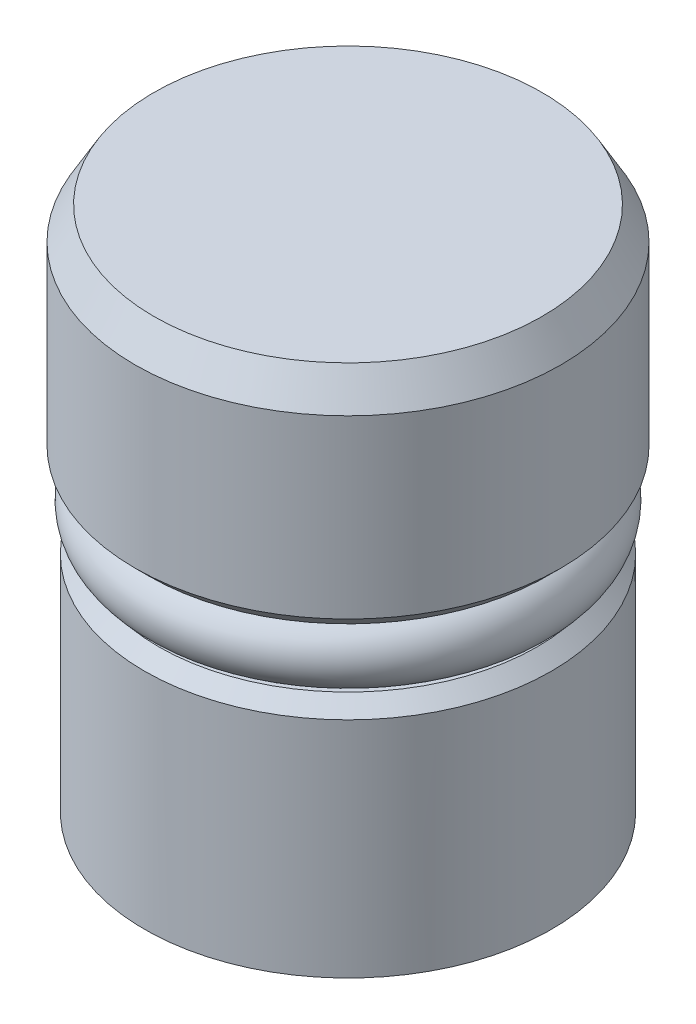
ISO-10303-21;
HEADER;
FILE_DESCRIPTION(('STEP AP214'),'2;1');
FILE_NAME('part.step','',(''),(''),'','','');
FILE_SCHEMA(('AUTOMOTIVE_DESIGN { 1 0 10303 214 1 1 1 1 }'));
ENDSEC;
DATA;
#1=APPLICATION_CONTEXT('core data for automotive mechanical design processes');
#2=APPLICATION_PROTOCOL_DEFINITION('international standard','automotive_design',2000,#1);
#3=PRODUCT_CONTEXT('',#1,'mechanical');
#4=PRODUCT('Part','Part','',(#3));
#5=PRODUCT_RELATED_PRODUCT_CATEGORY('part','',(#4));
#6=PRODUCT_DEFINITION_FORMATION('','',#4);
#7=PRODUCT_DEFINITION_CONTEXT('part definition',#1,'design');
#8=PRODUCT_DEFINITION('design','',#6,#7);
#9=PRODUCT_DEFINITION_SHAPE('','',#8);
#10=(LENGTH_UNIT() NAMED_UNIT(*) SI_UNIT(.MILLI.,.METRE.));
#11=(NAMED_UNIT(*) PLANE_ANGLE_UNIT() SI_UNIT($,.RADIAN.));
#12=(NAMED_UNIT(*) SI_UNIT($,.STERADIAN.) SOLID_ANGLE_UNIT());
#13=UNCERTAINTY_MEASURE_WITH_UNIT(LENGTH_MEASURE(1.E-05),#10,'distance_accuracy_value','');
#14=(GEOMETRIC_REPRESENTATION_CONTEXT(3) GLOBAL_UNCERTAINTY_ASSIGNED_CONTEXT((#13)) GLOBAL_UNIT_ASSIGNED_CONTEXT((#10,
#11,#12)) REPRESENTATION_CONTEXT('',''));
#15=CARTESIAN_POINT('',(0.,0.,0.));
#16=DIRECTION('',(0.,0.,1.));
#17=DIRECTION('',(1.,0.,0.));
#18=AXIS2_PLACEMENT_3D('',#15,#16,#17);
#19=CARTESIAN_POINT('',(0.,3.302,0.));
#20=DIRECTION('',(0.,1.,0.));
#21=DIRECTION('',(0.,0.,1.));
#22=AXIS2_PLACEMENT_3D('',#19,#20,#21);
#23=PLANE('',#22);
#24=CARTESIAN_POINT('',(0.,3.302,0.));
#25=DIRECTION('',(0.,-1.,0.));
#26=DIRECTION('',(0.,0.,-1.));
#27=AXIS2_PLACEMENT_3D('',#24,#25,#26);
#28=CIRCLE('',#27,2.5527);
#29=CARTESIAN_POINT('',(0.,3.302,-2.5527));
#30=VERTEX_POINT('',#29);
#31=EDGE_CURVE('P0_E46',#30,#30,#28,.T.);
#32=ORIENTED_EDGE('',*,*,#31,.T.);
#33=EDGE_LOOP('',(#32));
#34=FACE_BOUND('',#33,.T.);
#35=CARTESIAN_POINT('',(0.,3.302,0.));
#36=DIRECTION('',(0.,-1.,0.));
#37=DIRECTION('',(0.,0.,-1.));
#38=AXIS2_PLACEMENT_3D('',#35,#36,#37);
#39=CIRCLE('',#38,2.0193);
#40=CARTESIAN_POINT('',(0.,3.302,-2.0193));
#41=VERTEX_POINT('',#40);
#42=EDGE_CURVE('P0_E36',#41,#41,#39,.T.);
#43=ORIENTED_EDGE('',*,*,#42,.F.);
#44=EDGE_LOOP('',(#43));
#45=FACE_BOUND('',#44,.T.);
#46=ADVANCED_FACE('P0_F15',(#34,#45),#23,.F.);
#47=CARTESIAN_POINT('',(0.,0.,0.));
#48=DIRECTION('',(0.,-1.,0.));
#49=DIRECTION('',(0.,0.,-1.));
#50=AXIS2_PLACEMENT_3D('',#47,#48,#49);
#51=PLANE('',#50);
#52=CARTESIAN_POINT('',(0.,0.,0.));
#53=DIRECTION('',(0.,-1.,0.));
#54=DIRECTION('',(0.,0.,-1.));
#55=AXIS2_PLACEMENT_3D('',#52,#53,#54);
#56=CIRCLE('',#55,5.3310917);
#57=CARTESIAN_POINT('',(0.,0.,-5.3310917));
#58=VERTEX_POINT('',#57);
#59=EDGE_CURVE('P0_E35',#58,#58,#56,.T.);
#60=ORIENTED_EDGE('',*,*,#59,.F.);
#61=EDGE_LOOP('',(#60));
#62=FACE_BOUND('',#61,.T.);
#63=CARTESIAN_POINT('',(0.,0.,0.));
#64=DIRECTION('',(0.,-1.,0.));
#65=DIRECTION('',(0.,0.,-1.));
#66=AXIS2_PLACEMENT_3D('',#63,#64,#65);
#67=CIRCLE('',#66,5.4991);
#68=CARTESIAN_POINT('',(0.,0.,-5.4991));
#69=VERTEX_POINT('',#68);
#70=EDGE_CURVE('P0_E55',#69,#69,#67,.T.);
#71=ORIENTED_EDGE('',*,*,#70,.T.);
#72=EDGE_LOOP('',(#71));
#73=FACE_BOUND('',#72,.T.);
#74=ADVANCED_FACE('P0_F87',(#62,#73),#51,.T.);
#75=CARTESIAN_POINT('',(0.,0.,0.));
#76=DIRECTION('',(0.,-1.,0.));
#77=DIRECTION('',(0.,0.,-1.));
#78=AXIS2_PLACEMENT_3D('',#75,#76,#77);
#79=CYLINDRICAL_SURFACE('',#78,5.4991);
#80=CARTESIAN_POINT('',(0.,6.0452,0.));
#81=DIRECTION('',(0.,1.,0.));
#82=DIRECTION('',(0.,0.,1.));
#83=AXIS2_PLACEMENT_3D('',#80,#81,#82);
#84=CIRCLE('',#83,5.4991);
#85=CARTESIAN_POINT('',(0.,6.0452,5.4991));
#86=VERTEX_POINT('',#85);
#87=EDGE_CURVE('P0_E58',#86,#86,#84,.F.);
#88=ORIENTED_EDGE('',*,*,#87,.T.);
#89=EDGE_LOOP('',(#88));
#90=FACE_BOUND('',#89,.T.);
#91=ORIENTED_EDGE('',*,*,#70,.F.);
#92=EDGE_LOOP('',(#91));
#93=FACE_BOUND('',#92,.T.);
#94=ADVANCED_FACE('P0_F94',(#90,#93),#79,.T.);
#95=CARTESIAN_POINT('',(5.4991,6.4262,0.));
#96=DIRECTION('',(0.,1.,0.));
#97=DIRECTION('',(0.,0.,1.));
#98=AXIS2_PLACEMENT_3D('',#95,#96,#97);
#99=PLANE('',#98);
#100=CARTESIAN_POINT('',(0.,6.4262,0.));
#101=DIRECTION('',(0.,1.,0.));
#102=DIRECTION('',(0.,0.,1.));
#103=AXIS2_PLACEMENT_3D('',#100,#101,#102);
#104=CIRCLE('',#103,5.1181);
#105=CARTESIAN_POINT('',(0.,6.4262,5.1181));
#106=VERTEX_POINT('',#105);
#107=EDGE_CURVE('P0_E61',#106,#106,#104,.T.);
#108=ORIENTED_EDGE('',*,*,#107,.T.);
#109=EDGE_LOOP('',(#108));
#110=FACE_BOUND('',#109,.T.);
#111=CARTESIAN_POINT('',(0.,6.4262,0.));
#112=DIRECTION('',(0.,-1.,0.));
#113=DIRECTION('',(0.,0.,-1.));
#114=AXIS2_PLACEMENT_3D('',#111,#112,#113);
#115=CIRCLE('',#114,3.5306);
#116=CARTESIAN_POINT('',(0.,6.4262,-3.5306));
#117=VERTEX_POINT('',#116);
#118=EDGE_CURVE('P0_E52',#117,#117,#115,.T.);
#119=ORIENTED_EDGE('',*,*,#118,.T.);
#120=EDGE_LOOP('',(#119));
#121=FACE_BOUND('',#120,.T.);
#122=ADVANCED_FACE('P0_F115',(#110,#121),#99,.T.);
#123=CARTESIAN_POINT('',(0.,0.,0.));
#124=DIRECTION('',(0.,-1.,0.));
#125=DIRECTION('',(0.,0.,-1.));
#126=AXIS2_PLACEMENT_3D('',#123,#124,#125);
#127=CYLINDRICAL_SURFACE('',#126,3.5306);
#128=CARTESIAN_POINT('',(0.,8.2042,0.));
#129=DIRECTION('',(0.,-1.,0.));
#130=DIRECTION('',(0.,0.,-1.));
#131=AXIS2_PLACEMENT_3D('',#128,#129,#130);
#132=CIRCLE('',#131,3.5306);
#133=CARTESIAN_POINT('',(0.,8.2042,-3.5306));
#134=VERTEX_POINT('',#133);
#135=EDGE_CURVE('P0_E49',#134,#134,#132,.T.);
#136=ORIENTED_EDGE('',*,*,#135,.T.);
#137=EDGE_LOOP('',(#136));
#138=FACE_BOUND('',#137,.T.);
#139=ORIENTED_EDGE('',*,*,#118,.F.);
#140=EDGE_LOOP('',(#139));
#141=FACE_BOUND('',#140,.T.);
#142=ADVANCED_FACE('P0_F111',(#138,#141),#127,.T.);
#143=CARTESIAN_POINT('',(3.5306,8.2042,0.));
#144=DIRECTION('',(0.,-1.,0.));
#145=DIRECTION('',(0.,0.,-1.));
#146=AXIS2_PLACEMENT_3D('',#143,#144,#145);
#147=PLANE('',#146);
#148=CARTESIAN_POINT('',(0.,8.2042,0.));
#149=DIRECTION('',(0.,-1.,0.));
#150=DIRECTION('',(0.,0.,-1.));
#151=AXIS2_PLACEMENT_3D('',#148,#149,#150);
#152=CIRCLE('',#151,5.3736875);
#153=CARTESIAN_POINT('',(0.,8.2042,-5.3736875));
#154=VERTEX_POINT('',#153);
#155=EDGE_CURVE('P0_E64',#154,#154,#152,.T.);
#156=ORIENTED_EDGE('',*,*,#155,.T.);
#157=EDGE_LOOP('',(#156));
#158=FACE_BOUND('',#157,.T.);
#159=ORIENTED_EDGE('',*,*,#135,.F.);
#160=EDGE_LOOP('',(#159));
#161=FACE_BOUND('',#160,.T.);
#162=ADVANCED_FACE('P0_F108',(#158,#161),#147,.T.);
#163=CARTESIAN_POINT('',(0.,0.,0.));
#164=DIRECTION('',(0.,-1.,0.));
#165=DIRECTION('',(0.,0.,-1.));
#166=AXIS2_PLACEMENT_3D('',#163,#164,#165);
#167=CYLINDRICAL_SURFACE('',#166,5.7546875);
#168=CARTESIAN_POINT('',(0.,13.344118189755,0.));
#169=DIRECTION('',(0.,1.,0.));
#170=DIRECTION('',(0.,0.,1.));
#171=AXIS2_PLACEMENT_3D('',#168,#169,#170);
#172=CIRCLE('',#171,5.7546875);
#173=CARTESIAN_POINT('',(0.,13.344118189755,5.7546875));
#174=VERTEX_POINT('',#173);
#175=EDGE_CURVE('P0_E22',#174,#174,#172,.F.);
#176=ORIENTED_EDGE('',*,*,#175,.T.);
#177=EDGE_LOOP('',(#176));
#178=FACE_BOUND('',#177,.T.);
#179=CARTESIAN_POINT('',(0.,8.5852,0.));
#180=DIRECTION('',(0.,-1.,0.));
#181=DIRECTION('',(0.,0.,-1.));
#182=AXIS2_PLACEMENT_3D('',#179,#180,#181);
#183=CIRCLE('',#182,5.7546875);
#184=CARTESIAN_POINT('',(0.,8.5852,-5.7546875));
#185=VERTEX_POINT('',#184);
#186=EDGE_CURVE('P0_E67',#185,#185,#183,.F.);
#187=ORIENTED_EDGE('',*,*,#186,.T.);
#188=EDGE_LOOP('',(#187));
#189=FACE_BOUND('',#188,.T.);
#190=ADVANCED_FACE('P0_F72',(#178,#189),#167,.T.);
#191=CARTESIAN_POINT('',(5.7546875,14.224,0.));
#192=DIRECTION('',(0.,1.,0.));
#193=DIRECTION('',(0.,0.,1.));
#194=AXIS2_PLACEMENT_3D('',#191,#192,#193);
#195=PLANE('',#194);
#196=CARTESIAN_POINT('',(0.,14.224,0.));
#197=DIRECTION('',(0.,1.,0.));
#198=DIRECTION('',(0.,0.,1.));
#199=AXIS2_PLACEMENT_3D('',#196,#197,#198);
#200=CIRCLE('',#199,5.2466875);
#201=CARTESIAN_POINT('',(0.,14.224,5.2466875));
#202=VERTEX_POINT('',#201);
#203=EDGE_CURVE('P0_E10',#202,#202,#200,.T.);
#204=ORIENTED_EDGE('',*,*,#203,.T.);
#205=EDGE_LOOP('',(#204));
#206=FACE_BOUND('',#205,.T.);
#207=ADVANCED_FACE('P0_F102',(#206),#195,.T.);
#208=CARTESIAN_POINT('',(0.,0.,0.));
#209=DIRECTION('',(0.,-1.,0.));
#210=DIRECTION('',(0.,0.,-1.));
#211=AXIS2_PLACEMENT_3D('',#208,#209,#210);
#212=CYLINDRICAL_SURFACE('',#211,2.5527);
#213=ORIENTED_EDGE('',*,*,#31,.F.);
#214=EDGE_LOOP('',(#213));
#215=FACE_BOUND('',#214,.T.);
#216=CARTESIAN_POINT('',(0.,3.19617403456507,0.));
#217=DIRECTION('',(0.,-1.,0.));
#218=DIRECTION('',(0.,0.,-1.));
#219=AXIS2_PLACEMENT_3D('',#216,#217,#218);
#220=CIRCLE('',#219,2.5527);
#221=CARTESIAN_POINT('',(0.,3.19617403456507,-2.5527));
#222=VERTEX_POINT('',#221);
#223=EDGE_CURVE('P0_E39',#222,#222,#220,.T.);
#224=ORIENTED_EDGE('',*,*,#223,.T.);
#225=EDGE_LOOP('',(#224));
#226=FACE_BOUND('',#225,.T.);
#227=ADVANCED_FACE('P0_F100',(#215,#226),#212,.F.);
#228=CARTESIAN_POINT('',(0.,0.,0.));
#229=DIRECTION('',(0.,-1.,0.));
#230=DIRECTION('',(0.,0.,-1.));
#231=AXIS2_PLACEMENT_3D('',#228,#229,#230);
#232=CONICAL_SURFACE('',#231,5.3310917,0.715584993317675);
#233=ORIENTED_EDGE('',*,*,#223,.F.);
#234=EDGE_LOOP('',(#233));
#235=FACE_BOUND('',#234,.T.);
#236=ORIENTED_EDGE('',*,*,#59,.T.);
#237=EDGE_LOOP('',(#236));
#238=FACE_BOUND('',#237,.T.);
#239=ADVANCED_FACE('P0_F29',(#235,#238),#232,.F.);
#240=CARTESIAN_POINT('',(0.,11.176,0.));
#241=DIRECTION('',(0.,-1.,0.));
#242=DIRECTION('',(0.,0.,-1.));
#243=AXIS2_PLACEMENT_3D('',#240,#241,#242);
#244=CONICAL_SURFACE('',#243,2.0193,1.02974425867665);
#245=CARTESIAN_POINT('',(0.,12.3893178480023,0.));
#246=VERTEX_POINT('',#245);
#247=VERTEX_LOOP('',#246);
#248=FACE_BOUND('',#247,.T.);
#249=CARTESIAN_POINT('',(0.,11.176,0.));
#250=DIRECTION('',(0.,-1.,0.));
#251=DIRECTION('',(0.,0.,-1.));
#252=AXIS2_PLACEMENT_3D('',#249,#250,#251);
#253=CIRCLE('',#252,2.0193);
#254=CARTESIAN_POINT('',(0.,11.176,-2.0193));
#255=VERTEX_POINT('',#254);
#256=EDGE_CURVE('P0_E33',#255,#255,#253,.T.);
#257=ORIENTED_EDGE('',*,*,#256,.T.);
#258=EDGE_LOOP('',(#257));
#259=FACE_BOUND('',#258,.T.);
#260=ADVANCED_FACE('P0_F25',(#248,#259),#244,.F.);
#261=CARTESIAN_POINT('',(0.,3.302,0.));
#262=DIRECTION('',(0.,-1.,0.));
#263=DIRECTION('',(0.,0.,-1.));
#264=AXIS2_PLACEMENT_3D('',#261,#262,#263);
#265=CYLINDRICAL_SURFACE('',#264,2.0193);
#266=ORIENTED_EDGE('',*,*,#256,.F.);
#267=EDGE_LOOP('',(#266));
#268=FACE_BOUND('',#267,.T.);
#269=ORIENTED_EDGE('',*,*,#42,.T.);
#270=EDGE_LOOP('',(#269));
#271=FACE_BOUND('',#270,.T.);
#272=ADVANCED_FACE('P0_F28',(#268,#271),#265,.F.);
#273=CARTESIAN_POINT('',(0.,6.0452,0.));
#274=DIRECTION('',(0.,-1.,0.));
#275=DIRECTION('',(0.,0.,-1.));
#276=AXIS2_PLACEMENT_3D('',#273,#274,#275);
#277=CONICAL_SURFACE('',#276,5.4991,0.785398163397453);
#278=ORIENTED_EDGE('',*,*,#107,.F.);
#279=EDGE_LOOP('',(#278));
#280=FACE_BOUND('',#279,.T.);
#281=ORIENTED_EDGE('',*,*,#87,.F.);
#282=EDGE_LOOP('',(#281));
#283=FACE_BOUND('',#282,.T.);
#284=ADVANCED_FACE('P0_F83',(#280,#283),#277,.T.);
#285=CARTESIAN_POINT('',(0.,8.2042,0.));
#286=DIRECTION('',(0.,1.,0.));
#287=DIRECTION('',(0.,0.,1.));
#288=AXIS2_PLACEMENT_3D('',#285,#286,#287);
#289=CONICAL_SURFACE('',#288,5.3736875,0.785398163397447);
#290=ORIENTED_EDGE('',*,*,#186,.F.);
#291=EDGE_LOOP('',(#290));
#292=FACE_BOUND('',#291,.T.);
#293=ORIENTED_EDGE('',*,*,#155,.F.);
#294=EDGE_LOOP('',(#293));
#295=FACE_BOUND('',#294,.T.);
#296=ADVANCED_FACE('P0_F76',(#292,#295),#289,.T.);
#297=CARTESIAN_POINT('',(0.,13.344118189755,0.));
#298=DIRECTION('',(0.,-1.,0.));
#299=DIRECTION('',(0.,0.,-1.));
#300=AXIS2_PLACEMENT_3D('',#297,#298,#299);
#301=CONICAL_SURFACE('',#300,5.7546875,0.5235987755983);
#302=ORIENTED_EDGE('',*,*,#203,.F.);
#303=EDGE_LOOP('',(#302));
#304=FACE_BOUND('',#303,.T.);
#305=ORIENTED_EDGE('',*,*,#175,.F.);
#306=EDGE_LOOP('',(#305));
#307=FACE_BOUND('',#306,.T.);
#308=ADVANCED_FACE('P0_F17',(#304,#307),#301,.T.);
#309=CLOSED_SHELL('',(#46,#74,#94,#122,#142,#162,#190,#207,#227,#239,#260,#272,#284,#296,#308));
#310=MANIFOLD_SOLID_BREP('P0_B1',#309);
#311=CARTESIAN_POINT('',(0.,0.12814149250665,5.2197));
#312=DIRECTION('',(0.,-1.,0.));
#313=DIRECTION('',(-1.,0.,0.));
#314=AXIS2_PLACEMENT_3D('',#311,#312,#313);
#315=PLANE('',#314);
#316=DIRECTION('',(0.866025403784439,0.,0.5));
#317=VECTOR('',#316,1.);
#318=CARTESIAN_POINT('',(0.,0.12814149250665,-1.83308710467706));
#319=LINE('',#318,#317);
#320=CARTESIAN_POINT('',(0.,0.12814149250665,-1.83308710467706));
#321=VERTEX_POINT('',#320);
#322=CARTESIAN_POINT('',(1.5875,0.12814149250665,-0.916543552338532));
#323=VERTEX_POINT('',#322);
#324=EDGE_CURVE('P1_E30',#321,#323,#319,.T.);
#325=ORIENTED_EDGE('',*,*,#324,.F.);
#326=DIRECTION('',(0.866025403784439,0.,-0.5));
#327=VECTOR('',#326,1.);
#328=CARTESIAN_POINT('',(-1.5875,0.12814149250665,-0.916543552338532));
#329=LINE('',#328,#327);
#330=CARTESIAN_POINT('',(-1.5875,0.12814149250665,-0.916543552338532));
#331=VERTEX_POINT('',#330);
#332=EDGE_CURVE('P1_E113',#331,#321,#329,.T.);
#333=ORIENTED_EDGE('',*,*,#332,.F.);
#334=DIRECTION('',(0.,0.,-1.));
#335=VECTOR('',#334,1.);
#336=CARTESIAN_POINT('',(-1.5875,0.12814149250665,0.916543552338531));
#337=LINE('',#336,#335);
#338=CARTESIAN_POINT('',(-1.5875,0.12814149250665,0.916543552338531));
#339=VERTEX_POINT('',#338);
#340=EDGE_CURVE('P1_E111',#339,#331,#337,.T.);
#341=ORIENTED_EDGE('',*,*,#340,.F.);
#342=DIRECTION('',(-0.866025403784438,0.,-0.5));
#343=VECTOR('',#342,1.);
#344=CARTESIAN_POINT('',(0.,0.12814149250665,1.83308710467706));
#345=LINE('',#344,#343);
#346=CARTESIAN_POINT('',(0.,0.12814149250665,1.83308710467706));
#347=VERTEX_POINT('',#346);
#348=EDGE_CURVE('P1_E78',#347,#339,#345,.T.);
#349=ORIENTED_EDGE('',*,*,#348,.F.);
#350=DIRECTION('',(-0.866025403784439,0.,0.5));
#351=VECTOR('',#350,1.);
#352=CARTESIAN_POINT('',(1.5875,0.12814149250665,0.916543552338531));
#353=LINE('',#352,#351);
#354=CARTESIAN_POINT('',(1.5875,0.12814149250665,0.916543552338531));
#355=VERTEX_POINT('',#354);
#356=EDGE_CURVE('P1_E107',#355,#347,#353,.T.);
#357=ORIENTED_EDGE('',*,*,#356,.F.);
#358=DIRECTION('',(0.,0.,1.));
#359=VECTOR('',#358,1.);
#360=CARTESIAN_POINT('',(1.5875,0.12814149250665,-0.916543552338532));
#361=LINE('',#360,#359);
#362=EDGE_CURVE('P1_E104',#323,#355,#361,.T.);
#363=ORIENTED_EDGE('',*,*,#362,.F.);
#364=EDGE_LOOP('',(#325,#333,#341,#349,#357,#363));
#365=FACE_BOUND('',#364,.T.);
#366=CARTESIAN_POINT('',(0.,0.12814149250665,0.));
#367=DIRECTION('',(0.,1.,0.));
#368=DIRECTION('',(1.,0.,0.));
#369=AXIS2_PLACEMENT_3D('',#366,#367,#368);
#370=CIRCLE('',#369,5.2197);
#371=CARTESIAN_POINT('',(5.2197,0.12814149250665,0.));
#372=VERTEX_POINT('',#371);
#373=EDGE_CURVE('P1_E11',#372,#372,#370,.T.);
#374=ORIENTED_EDGE('',*,*,#373,.F.);
#375=EDGE_LOOP('',(#374));
#376=FACE_BOUND('',#375,.T.);
#377=ADVANCED_FACE('P1_F16',(#365,#376),#315,.T.);
#378=CARTESIAN_POINT('',(0.,3.35688050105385,0.));
#379=DIRECTION('',(0.,-1.,0.));
#380=DIRECTION('',(-1.,0.,0.));
#381=AXIS2_PLACEMENT_3D('',#378,#379,#380);
#382=CONICAL_SURFACE('',#381,2.413,0.715584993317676);
#383=ORIENTED_EDGE('',*,*,#373,.T.);
#384=EDGE_LOOP('',(#383));
#385=FACE_BOUND('',#384,.T.);
#386=CARTESIAN_POINT('',(0.,3.35688050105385,0.));
#387=DIRECTION('',(0.,1.,0.));
#388=DIRECTION('',(1.,0.,0.));
#389=AXIS2_PLACEMENT_3D('',#386,#387,#388);
#390=CIRCLE('',#389,2.413);
#391=CARTESIAN_POINT('',(2.413,3.35688050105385,0.));
#392=VERTEX_POINT('',#391);
#393=EDGE_CURVE('P1_E23',#392,#392,#390,.T.);
#394=ORIENTED_EDGE('',*,*,#393,.F.);
#395=EDGE_LOOP('',(#394));
#396=FACE_BOUND('',#395,.T.);
#397=ADVANCED_FACE('P1_F130',(#385,#396),#382,.T.);
#398=CARTESIAN_POINT('',(0.,8.06564149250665,0.));
#399=DIRECTION('',(0.,1.,0.));
#400=DIRECTION('',(1.,0.,0.));
#401=AXIS2_PLACEMENT_3D('',#398,#399,#400);
#402=CYLINDRICAL_SURFACE('',#401,2.413);
#403=ORIENTED_EDGE('',*,*,#393,.T.);
#404=EDGE_LOOP('',(#403));
#405=FACE_BOUND('',#404,.T.);
#406=CARTESIAN_POINT('',(0.,8.06564149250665,0.));
#407=DIRECTION('',(0.,1.,0.));
#408=DIRECTION('',(1.,0.,0.));
#409=AXIS2_PLACEMENT_3D('',#406,#407,#408);
#410=CIRCLE('',#409,2.413);
#411=CARTESIAN_POINT('',(2.413,8.06564149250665,0.));
#412=VERTEX_POINT('',#411);
#413=EDGE_CURVE('P1_E117',#412,#412,#410,.T.);
#414=ORIENTED_EDGE('',*,*,#413,.F.);
#415=EDGE_LOOP('',(#414));
#416=FACE_BOUND('',#415,.T.);
#417=ADVANCED_FACE('P1_F127',(#405,#416),#402,.T.);
#418=CARTESIAN_POINT('',(0.,8.06564149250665,0.));
#419=DIRECTION('',(0.,1.,0.));
#420=DIRECTION('',(1.,0.,0.));
#421=AXIS2_PLACEMENT_3D('',#418,#419,#420);
#422=PLANE('',#421);
#423=ORIENTED_EDGE('',*,*,#413,.T.);
#424=EDGE_LOOP('',(#423));
#425=FACE_BOUND('',#424,.T.);
#426=ADVANCED_FACE('P1_F139',(#425),#422,.T.);
#427=CARTESIAN_POINT('',(0.,3.17614149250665,-1.83308710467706));
#428=DIRECTION('',(0.5,0.,-0.866025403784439));
#429=DIRECTION('',(-0.866025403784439,0.,-0.5));
#430=AXIS2_PLACEMENT_3D('',#427,#428,#429);
#431=PLANE('',#430);
#432=ORIENTED_EDGE('',*,*,#324,.T.);
#433=DIRECTION('',(0.,-1.,0.));
#434=VECTOR('',#433,1.);
#435=CARTESIAN_POINT('',(1.5875,3.17614149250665,-0.916543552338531));
#436=LINE('',#435,#434);
#437=CARTESIAN_POINT('',(1.5875,3.17614149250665,-0.916543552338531));
#438=VERTEX_POINT('',#437);
#439=EDGE_CURVE('P1_E60',#438,#323,#436,.T.);
#440=ORIENTED_EDGE('',*,*,#439,.F.);
#441=DIRECTION('',(0.866025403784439,0.,0.5));
#442=VECTOR('',#441,1.);
#443=CARTESIAN_POINT('',(0.,3.17614149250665,-1.83308710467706));
#444=LINE('',#443,#442);
#445=CARTESIAN_POINT('',(0.,3.17614149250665,-1.83308710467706));
#446=VERTEX_POINT('',#445);
#447=EDGE_CURVE('P1_E115',#446,#438,#444,.T.);
#448=ORIENTED_EDGE('',*,*,#447,.F.);
#449=DIRECTION('',(0.,-1.,0.));
#450=VECTOR('',#449,1.);
#451=CARTESIAN_POINT('',(0.,3.17614149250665,-1.83308710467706));
#452=LINE('',#451,#450);
#453=EDGE_CURVE('P1_E38',#446,#321,#452,.T.);
#454=ORIENTED_EDGE('',*,*,#453,.T.);
#455=EDGE_LOOP('',(#432,#440,#448,#454));
#456=FACE_BOUND('',#455,.T.);
#457=ADVANCED_FACE('P1_F145',(#456),#431,.F.);
#458=CARTESIAN_POINT('',(-1.5875,3.17614149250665,-0.916543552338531));
#459=DIRECTION('',(-0.5,0.,-0.866025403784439));
#460=DIRECTION('',(-0.866025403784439,0.,0.5));
#461=AXIS2_PLACEMENT_3D('',#458,#459,#460);
#462=PLANE('',#461);
#463=ORIENTED_EDGE('',*,*,#332,.T.);
#464=ORIENTED_EDGE('',*,*,#453,.F.);
#465=DIRECTION('',(0.866025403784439,0.,-0.5));
#466=VECTOR('',#465,1.);
#467=CARTESIAN_POINT('',(-1.5875,3.17614149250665,-0.916543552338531));
#468=LINE('',#467,#466);
#469=CARTESIAN_POINT('',(-1.5875,3.17614149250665,-0.916543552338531));
#470=VERTEX_POINT('',#469);
#471=EDGE_CURVE('P1_E90',#470,#446,#468,.T.);
#472=ORIENTED_EDGE('',*,*,#471,.F.);
#473=DIRECTION('',(0.,-1.,0.));
#474=VECTOR('',#473,1.);
#475=CARTESIAN_POINT('',(-1.5875,3.17614149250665,-0.916543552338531));
#476=LINE('',#475,#474);
#477=EDGE_CURVE('P1_E82',#470,#331,#476,.T.);
#478=ORIENTED_EDGE('',*,*,#477,.T.);
#479=EDGE_LOOP('',(#463,#464,#472,#478));
#480=FACE_BOUND('',#479,.T.);
#481=ADVANCED_FACE('P1_F149',(#480),#462,.F.);
#482=CARTESIAN_POINT('',(-1.5875,3.17614149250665,0.916543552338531));
#483=DIRECTION('',(-1.,0.,0.));
#484=DIRECTION('',(0.,0.,1.));
#485=AXIS2_PLACEMENT_3D('',#482,#483,#484);
#486=PLANE('',#485);
#487=ORIENTED_EDGE('',*,*,#340,.T.);
#488=ORIENTED_EDGE('',*,*,#477,.F.);
#489=DIRECTION('',(0.,0.,-1.));
#490=VECTOR('',#489,1.);
#491=CARTESIAN_POINT('',(-1.5875,3.17614149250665,0.916543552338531));
#492=LINE('',#491,#490);
#493=CARTESIAN_POINT('',(-1.5875,3.17614149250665,0.916543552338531));
#494=VERTEX_POINT('',#493);
#495=EDGE_CURVE('P1_E86',#494,#470,#492,.T.);
#496=ORIENTED_EDGE('',*,*,#495,.F.);
#497=DIRECTION('',(0.,-1.,0.));
#498=VECTOR('',#497,1.);
#499=CARTESIAN_POINT('',(-1.5875,3.17614149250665,0.916543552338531));
#500=LINE('',#499,#498);
#501=EDGE_CURVE('P1_E71',#494,#339,#500,.T.);
#502=ORIENTED_EDGE('',*,*,#501,.T.);
#503=EDGE_LOOP('',(#487,#488,#496,#502));
#504=FACE_BOUND('',#503,.T.);
#505=ADVANCED_FACE('P1_F87',(#504),#486,.F.);
#506=CARTESIAN_POINT('',(0.,3.17614149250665,1.83308710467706));
#507=DIRECTION('',(-0.5,0.,0.866025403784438));
#508=DIRECTION('',(0.866025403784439,0.,0.5));
#509=AXIS2_PLACEMENT_3D('',#506,#507,#508);
#510=PLANE('',#509);
#511=ORIENTED_EDGE('',*,*,#348,.T.);
#512=ORIENTED_EDGE('',*,*,#501,.F.);
#513=DIRECTION('',(-0.866025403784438,0.,-0.5));
#514=VECTOR('',#513,1.);
#515=CARTESIAN_POINT('',(0.,3.17614149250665,1.83308710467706));
#516=LINE('',#515,#514);
#517=CARTESIAN_POINT('',(0.,3.17614149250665,1.83308710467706));
#518=VERTEX_POINT('',#517);
#519=EDGE_CURVE('P1_E75',#518,#494,#516,.T.);
#520=ORIENTED_EDGE('',*,*,#519,.F.);
#521=DIRECTION('',(0.,-1.,0.));
#522=VECTOR('',#521,1.);
#523=CARTESIAN_POINT('',(0.,3.17614149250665,1.83308710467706));
#524=LINE('',#523,#522);
#525=EDGE_CURVE('P1_E83',#518,#347,#524,.T.);
#526=ORIENTED_EDGE('',*,*,#525,.T.);
#527=EDGE_LOOP('',(#511,#512,#520,#526));
#528=FACE_BOUND('',#527,.T.);
#529=ADVANCED_FACE('P1_F73',(#528),#510,.F.);
#530=CARTESIAN_POINT('',(1.5875,3.17614149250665,0.916543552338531));
#531=DIRECTION('',(0.5,0.,0.866025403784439));
#532=DIRECTION('',(0.866025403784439,0.,-0.5));
#533=AXIS2_PLACEMENT_3D('',#530,#531,#532);
#534=PLANE('',#533);
#535=ORIENTED_EDGE('',*,*,#356,.T.);
#536=ORIENTED_EDGE('',*,*,#525,.F.);
#537=DIRECTION('',(-0.866025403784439,0.,0.5));
#538=VECTOR('',#537,1.);
#539=CARTESIAN_POINT('',(1.5875,3.17614149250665,0.916543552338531));
#540=LINE('',#539,#538);
#541=CARTESIAN_POINT('',(1.5875,3.17614149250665,0.916543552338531));
#542=VERTEX_POINT('',#541);
#543=EDGE_CURVE('P1_E96',#542,#518,#540,.T.);
#544=ORIENTED_EDGE('',*,*,#543,.F.);
#545=DIRECTION('',(0.,-1.,0.));
#546=VECTOR('',#545,1.);
#547=CARTESIAN_POINT('',(1.5875,3.17614149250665,0.916543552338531));
#548=LINE('',#547,#546);
#549=EDGE_CURVE('P1_E120',#542,#355,#548,.T.);
#550=ORIENTED_EDGE('',*,*,#549,.T.);
#551=EDGE_LOOP('',(#535,#536,#544,#550));
#552=FACE_BOUND('',#551,.T.);
#553=ADVANCED_FACE('P1_F153',(#552),#534,.F.);
#554=CARTESIAN_POINT('',(1.5875,3.17614149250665,-0.916543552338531));
#555=DIRECTION('',(1.,0.,0.));
#556=DIRECTION('',(0.,-1.,0.));
#557=AXIS2_PLACEMENT_3D('',#554,#555,#556);
#558=PLANE('',#557);
#559=ORIENTED_EDGE('',*,*,#362,.T.);
#560=ORIENTED_EDGE('',*,*,#549,.F.);
#561=DIRECTION('',(0.,0.,1.));
#562=VECTOR('',#561,1.);
#563=CARTESIAN_POINT('',(1.5875,3.17614149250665,-0.916543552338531));
#564=LINE('',#563,#562);
#565=EDGE_CURVE('P1_E98',#438,#542,#564,.T.);
#566=ORIENTED_EDGE('',*,*,#565,.F.);
#567=ORIENTED_EDGE('',*,*,#439,.T.);
#568=EDGE_LOOP('',(#559,#560,#566,#567));
#569=FACE_BOUND('',#568,.T.);
#570=ADVANCED_FACE('P1_F150',(#569),#558,.F.);
#571=CARTESIAN_POINT('',(3.175,3.17614149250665,0.));
#572=DIRECTION('',(0.,-1.,0.));
#573=DIRECTION('',(-1.,0.,0.));
#574=AXIS2_PLACEMENT_3D('',#571,#572,#573);
#575=PLANE('',#574);
#576=ORIENTED_EDGE('',*,*,#447,.T.);
#577=ORIENTED_EDGE('',*,*,#565,.T.);
#578=ORIENTED_EDGE('',*,*,#543,.T.);
#579=ORIENTED_EDGE('',*,*,#519,.T.);
#580=ORIENTED_EDGE('',*,*,#495,.T.);
#581=ORIENTED_EDGE('',*,*,#471,.T.);
#582=EDGE_LOOP('',(#576,#577,#578,#579,#580,#581));
#583=FACE_BOUND('',#582,.T.);
#584=ADVANCED_FACE('P1_F93',(#583),#575,.T.);
#585=CLOSED_SHELL('',(#377,#397,#417,#426,#457,#481,#505,#529,#553,#570,#584));
#586=MANIFOLD_SOLID_BREP('P1_B1',#585);
#587=CARTESIAN_POINT('',(0.,7.3152,0.));
#588=DIRECTION('',(0.,-1.,0.));
#589=DIRECTION('',(0.,0.,-1.));
#590=AXIS2_PLACEMENT_3D('',#587,#588,#589);
#591=TOROIDAL_SURFACE('',#590,4.7117,0.889);
#592=CARTESIAN_POINT('',(0.,7.3152,-5.6007));
#593=VERTEX_POINT('',#592);
#594=VERTEX_LOOP('',#593);
#595=FACE_BOUND('',#594,.T.);
#596=ADVANCED_FACE('P2_F11',(#595),#591,.T.);
#597=CLOSED_SHELL('',(#596));
#598=MANIFOLD_SOLID_BREP('P2_B1',#597);
#599=ADVANCED_BREP_SHAPE_REPRESENTATION('',(#18,#310,#586,#598),#14);
#600=SHAPE_DEFINITION_REPRESENTATION(#9,#599);
ENDSEC;
END-ISO-10303-21;
